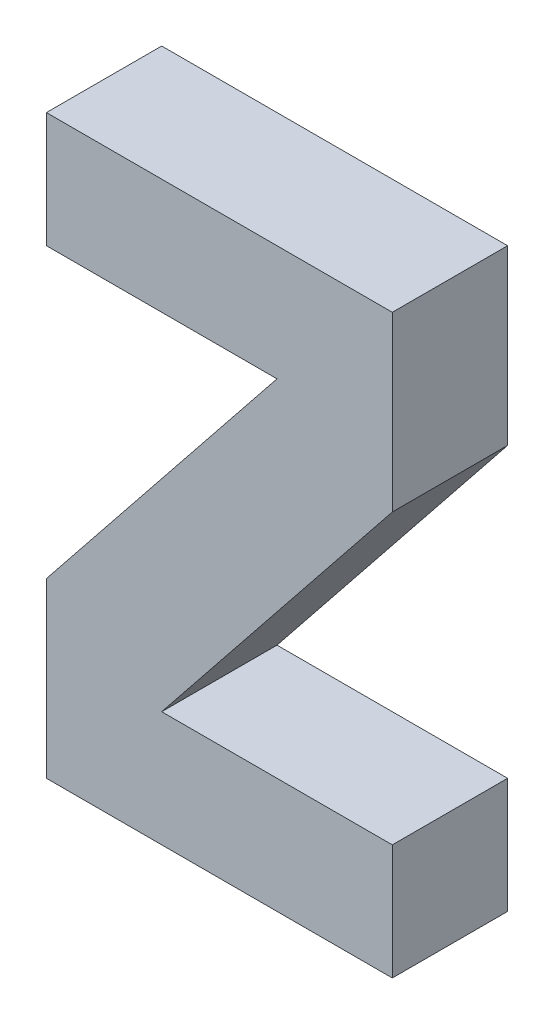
ISO-10303-21;
HEADER;
FILE_DESCRIPTION(('STEP AP214'),'2;1');
FILE_NAME('part.step','',(''),(''),'','','');
FILE_SCHEMA(('AUTOMOTIVE_DESIGN { 1 0 10303 214 1 1 1 1 }'));
ENDSEC;
DATA;
#1=APPLICATION_CONTEXT('core data for automotive mechanical design processes');
#2=APPLICATION_PROTOCOL_DEFINITION('international standard','automotive_design',2000,#1);
#3=PRODUCT_CONTEXT('',#1,'mechanical');
#4=PRODUCT('Part','Part','',(#3));
#5=PRODUCT_RELATED_PRODUCT_CATEGORY('part','',(#4));
#6=PRODUCT_DEFINITION_FORMATION('','',#4);
#7=PRODUCT_DEFINITION_CONTEXT('part definition',#1,'design');
#8=PRODUCT_DEFINITION('design','',#6,#7);
#9=PRODUCT_DEFINITION_SHAPE('','',#8);
#10=(LENGTH_UNIT() NAMED_UNIT(*) SI_UNIT(.MILLI.,.METRE.));
#11=(NAMED_UNIT(*) PLANE_ANGLE_UNIT() SI_UNIT($,.RADIAN.));
#12=(NAMED_UNIT(*) SI_UNIT($,.STERADIAN.) SOLID_ANGLE_UNIT());
#13=UNCERTAINTY_MEASURE_WITH_UNIT(LENGTH_MEASURE(1.E-05),#10,'distance_accuracy_value','');
#14=(GEOMETRIC_REPRESENTATION_CONTEXT(3) GLOBAL_UNCERTAINTY_ASSIGNED_CONTEXT((#13)) GLOBAL_UNIT_ASSIGNED_CONTEXT((#10,
#11,#12)) REPRESENTATION_CONTEXT('',''));
#15=CARTESIAN_POINT('',(0.,0.,0.));
#16=DIRECTION('',(0.,0.,1.));
#17=DIRECTION('',(1.,0.,0.));
#18=AXIS2_PLACEMENT_3D('',#15,#16,#17);
#19=CARTESIAN_POINT('',(0.,0.,10.));
#20=DIRECTION('',(1.,0.,0.));
#21=DIRECTION('',(0.,0.,-1.));
#22=AXIS2_PLACEMENT_3D('',#19,#20,#21);
#23=PLANE('',#22);
#24=DIRECTION('',(0.,-1.,0.));
#25=VECTOR('',#24,1.);
#26=CARTESIAN_POINT('',(0.,0.,0.));
#27=LINE('',#26,#25);
#28=CARTESIAN_POINT('',(0.,15.,0.));
#29=VERTEX_POINT('',#28);
#30=CARTESIAN_POINT('',(0.,0.,0.));
#31=VERTEX_POINT('',#30);
#32=EDGE_CURVE('E141',#29,#31,#27,.T.);
#33=ORIENTED_EDGE('',*,*,#32,.T.);
#34=DIRECTION('',(0.,0.,-1.));
#35=VECTOR('',#34,1.);
#36=CARTESIAN_POINT('',(0.,0.,10.));
#37=LINE('',#36,#35);
#38=CARTESIAN_POINT('',(0.,0.,10.));
#39=VERTEX_POINT('',#38);
#40=EDGE_CURVE('E11',#39,#31,#37,.T.);
#41=ORIENTED_EDGE('',*,*,#40,.F.);
#42=DIRECTION('',(0.,-1.,0.));
#43=VECTOR('',#42,1.);
#44=CARTESIAN_POINT('',(0.,0.,10.));
#45=LINE('',#44,#43);
#46=CARTESIAN_POINT('',(0.,15.,10.));
#47=VERTEX_POINT('',#46);
#48=EDGE_CURVE('E159',#47,#39,#45,.T.);
#49=ORIENTED_EDGE('',*,*,#48,.F.);
#50=DIRECTION('',(0.,0.,-1.));
#51=VECTOR('',#50,1.);
#52=CARTESIAN_POINT('',(0.,15.,10.));
#53=LINE('',#52,#51);
#54=EDGE_CURVE('E137',#47,#29,#53,.T.);
#55=ORIENTED_EDGE('',*,*,#54,.T.);
#56=EDGE_LOOP('',(#33,#41,#49,#55));
#57=FACE_BOUND('',#56,.T.);
#58=ADVANCED_FACE('F33',(#57),#23,.F.);
#59=CARTESIAN_POINT('',(0.,0.,10.));
#60=DIRECTION('',(0.,1.,0.));
#61=DIRECTION('',(0.,0.,1.));
#62=AXIS2_PLACEMENT_3D('',#59,#60,#61);
#63=PLANE('',#62);
#64=DIRECTION('',(1.,0.,0.));
#65=VECTOR('',#64,1.);
#66=CARTESIAN_POINT('',(0.,0.,0.));
#67=LINE('',#66,#65);
#68=CARTESIAN_POINT('',(30.,0.,0.));
#69=VERTEX_POINT('',#68);
#70=EDGE_CURVE('E144',#31,#69,#67,.T.);
#71=ORIENTED_EDGE('',*,*,#70,.T.);
#72=DIRECTION('',(0.,0.,-1.));
#73=VECTOR('',#72,1.);
#74=CARTESIAN_POINT('',(30.,0.,10.));
#75=LINE('',#74,#73);
#76=CARTESIAN_POINT('',(30.,0.,10.));
#77=VERTEX_POINT('',#76);
#78=EDGE_CURVE('E41',#77,#69,#75,.T.);
#79=ORIENTED_EDGE('',*,*,#78,.F.);
#80=DIRECTION('',(1.,0.,0.));
#81=VECTOR('',#80,1.);
#82=CARTESIAN_POINT('',(0.,0.,10.));
#83=LINE('',#82,#81);
#84=EDGE_CURVE('E98',#39,#77,#83,.T.);
#85=ORIENTED_EDGE('',*,*,#84,.F.);
#86=ORIENTED_EDGE('',*,*,#40,.T.);
#87=EDGE_LOOP('',(#71,#79,#85,#86));
#88=FACE_BOUND('',#87,.T.);
#89=ADVANCED_FACE('F208',(#88),#63,.F.);
#90=CARTESIAN_POINT('',(30.,0.,10.));
#91=DIRECTION('',(-1.,0.,0.));
#92=DIRECTION('',(0.,0.,1.));
#93=AXIS2_PLACEMENT_3D('',#90,#91,#92);
#94=PLANE('',#93);
#95=DIRECTION('',(0.,1.,0.));
#96=VECTOR('',#95,1.);
#97=CARTESIAN_POINT('',(30.,0.,0.));
#98=LINE('',#97,#96);
#99=CARTESIAN_POINT('',(30.,10.,0.));
#100=VERTEX_POINT('',#99);
#101=EDGE_CURVE('E146',#69,#100,#98,.T.);
#102=ORIENTED_EDGE('',*,*,#101,.T.);
#103=DIRECTION('',(0.,0.,-1.));
#104=VECTOR('',#103,1.);
#105=CARTESIAN_POINT('',(30.,10.,10.));
#106=LINE('',#105,#104);
#107=CARTESIAN_POINT('',(30.,10.,10.));
#108=VERTEX_POINT('',#107);
#109=EDGE_CURVE('E172',#108,#100,#106,.T.);
#110=ORIENTED_EDGE('',*,*,#109,.F.);
#111=DIRECTION('',(0.,1.,0.));
#112=VECTOR('',#111,1.);
#113=CARTESIAN_POINT('',(30.,0.,10.));
#114=LINE('',#113,#112);
#115=EDGE_CURVE('E180',#77,#108,#114,.T.);
#116=ORIENTED_EDGE('',*,*,#115,.F.);
#117=ORIENTED_EDGE('',*,*,#78,.T.);
#118=EDGE_LOOP('',(#102,#110,#116,#117));
#119=FACE_BOUND('',#118,.T.);
#120=ADVANCED_FACE('F178',(#119),#94,.F.);
#121=CARTESIAN_POINT('',(30.,10.,10.));
#122=DIRECTION('',(0.,-1.,0.));
#123=DIRECTION('',(1.,0.,0.));
#124=AXIS2_PLACEMENT_3D('',#121,#122,#123);
#125=PLANE('',#124);
#126=DIRECTION('',(-1.,0.,0.));
#127=VECTOR('',#126,1.);
#128=CARTESIAN_POINT('',(30.,10.,0.));
#129=LINE('',#128,#127);
#130=CARTESIAN_POINT('',(10.,10.,0.));
#131=VERTEX_POINT('',#130);
#132=EDGE_CURVE('E148',#100,#131,#129,.T.);
#133=ORIENTED_EDGE('',*,*,#132,.T.);
#134=DIRECTION('',(0.,0.,-1.));
#135=VECTOR('',#134,1.);
#136=CARTESIAN_POINT('',(10.,10.,10.));
#137=LINE('',#136,#135);
#138=CARTESIAN_POINT('',(10.,10.,10.));
#139=VERTEX_POINT('',#138);
#140=EDGE_CURVE('E169',#139,#131,#137,.T.);
#141=ORIENTED_EDGE('',*,*,#140,.F.);
#142=DIRECTION('',(-1.,0.,0.));
#143=VECTOR('',#142,1.);
#144=CARTESIAN_POINT('',(30.,10.,10.));
#145=LINE('',#144,#143);
#146=EDGE_CURVE('E198',#108,#139,#145,.T.);
#147=ORIENTED_EDGE('',*,*,#146,.F.);
#148=ORIENTED_EDGE('',*,*,#109,.T.);
#149=EDGE_LOOP('',(#133,#141,#147,#148));
#150=FACE_BOUND('',#149,.T.);
#151=ADVANCED_FACE('F189',(#150),#125,.F.);
#152=CARTESIAN_POINT('',(10.,10.,10.));
#153=DIRECTION('',(-0.78086880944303,0.624695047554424,0.));
#154=DIRECTION('',(-0.624695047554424,-0.78086880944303,0.));
#155=AXIS2_PLACEMENT_3D('',#152,#153,#154);
#156=PLANE('',#155);
#157=DIRECTION('',(0.624695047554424,0.78086880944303,0.));
#158=VECTOR('',#157,1.);
#159=CARTESIAN_POINT('',(10.,10.,0.));
#160=LINE('',#159,#158);
#161=CARTESIAN_POINT('',(30.,35.,0.));
#162=VERTEX_POINT('',#161);
#163=EDGE_CURVE('E150',#131,#162,#160,.T.);
#164=ORIENTED_EDGE('',*,*,#163,.T.);
#165=DIRECTION('',(0.,0.,-1.));
#166=VECTOR('',#165,1.);
#167=CARTESIAN_POINT('',(30.,35.,10.));
#168=LINE('',#167,#166);
#169=CARTESIAN_POINT('',(30.,35.,10.));
#170=VERTEX_POINT('',#169);
#171=EDGE_CURVE('E166',#170,#162,#168,.T.);
#172=ORIENTED_EDGE('',*,*,#171,.F.);
#173=DIRECTION('',(0.624695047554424,0.78086880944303,0.));
#174=VECTOR('',#173,1.);
#175=CARTESIAN_POINT('',(10.,10.,10.));
#176=LINE('',#175,#174);
#177=EDGE_CURVE('E195',#139,#170,#176,.T.);
#178=ORIENTED_EDGE('',*,*,#177,.F.);
#179=ORIENTED_EDGE('',*,*,#140,.T.);
#180=EDGE_LOOP('',(#164,#172,#178,#179));
#181=FACE_BOUND('',#180,.T.);
#182=ADVANCED_FACE('F193',(#181),#156,.F.);
#183=CARTESIAN_POINT('',(30.,35.,10.));
#184=DIRECTION('',(-1.,0.,0.));
#185=DIRECTION('',(0.,0.,1.));
#186=AXIS2_PLACEMENT_3D('',#183,#184,#185);
#187=PLANE('',#186);
#188=DIRECTION('',(0.,1.,0.));
#189=VECTOR('',#188,1.);
#190=CARTESIAN_POINT('',(30.,35.,0.));
#191=LINE('',#190,#189);
#192=CARTESIAN_POINT('',(30.,50.,0.));
#193=VERTEX_POINT('',#192);
#194=EDGE_CURVE('E152',#162,#193,#191,.T.);
#195=ORIENTED_EDGE('',*,*,#194,.T.);
#196=DIRECTION('',(0.,0.,-1.));
#197=VECTOR('',#196,1.);
#198=CARTESIAN_POINT('',(30.,50.,10.));
#199=LINE('',#198,#197);
#200=CARTESIAN_POINT('',(30.,50.,10.));
#201=VERTEX_POINT('',#200);
#202=EDGE_CURVE('E163',#201,#193,#199,.T.);
#203=ORIENTED_EDGE('',*,*,#202,.F.);
#204=DIRECTION('',(0.,1.,0.));
#205=VECTOR('',#204,1.);
#206=CARTESIAN_POINT('',(30.,35.,10.));
#207=LINE('',#206,#205);
#208=EDGE_CURVE('E197',#170,#201,#207,.T.);
#209=ORIENTED_EDGE('',*,*,#208,.F.);
#210=ORIENTED_EDGE('',*,*,#171,.T.);
#211=EDGE_LOOP('',(#195,#203,#209,#210));
#212=FACE_BOUND('',#211,.T.);
#213=ADVANCED_FACE('F220',(#212),#187,.F.);
#214=CARTESIAN_POINT('',(0.,50.,10.));
#215=DIRECTION('',(0.,-1.,0.));
#216=DIRECTION('',(0.,0.,-1.));
#217=AXIS2_PLACEMENT_3D('',#214,#215,#216);
#218=PLANE('',#217);
#219=DIRECTION('',(-1.,0.,0.));
#220=VECTOR('',#219,1.);
#221=CARTESIAN_POINT('',(0.,50.,0.));
#222=LINE('',#221,#220);
#223=CARTESIAN_POINT('',(0.,50.,0.));
#224=VERTEX_POINT('',#223);
#225=EDGE_CURVE('E154',#193,#224,#222,.T.);
#226=ORIENTED_EDGE('',*,*,#225,.T.);
#227=DIRECTION('',(0.,0.,-1.));
#228=VECTOR('',#227,1.);
#229=CARTESIAN_POINT('',(0.,50.,10.));
#230=LINE('',#229,#228);
#231=CARTESIAN_POINT('',(0.,50.,10.));
#232=VERTEX_POINT('',#231);
#233=EDGE_CURVE('E132',#232,#224,#230,.T.);
#234=ORIENTED_EDGE('',*,*,#233,.F.);
#235=DIRECTION('',(-1.,0.,0.));
#236=VECTOR('',#235,1.);
#237=CARTESIAN_POINT('',(0.,50.,10.));
#238=LINE('',#237,#236);
#239=EDGE_CURVE('E123',#201,#232,#238,.T.);
#240=ORIENTED_EDGE('',*,*,#239,.F.);
#241=ORIENTED_EDGE('',*,*,#202,.T.);
#242=EDGE_LOOP('',(#226,#234,#240,#241));
#243=FACE_BOUND('',#242,.T.);
#244=ADVANCED_FACE('F223',(#243),#218,.F.);
#245=CARTESIAN_POINT('',(0.,40.,10.));
#246=DIRECTION('',(1.,0.,0.));
#247=DIRECTION('',(0.,0.,-1.));
#248=AXIS2_PLACEMENT_3D('',#245,#246,#247);
#249=PLANE('',#248);
#250=DIRECTION('',(0.,-1.,0.));
#251=VECTOR('',#250,1.);
#252=CARTESIAN_POINT('',(0.,40.,0.));
#253=LINE('',#252,#251);
#254=CARTESIAN_POINT('',(0.,40.,0.));
#255=VERTEX_POINT('',#254);
#256=EDGE_CURVE('E131',#224,#255,#253,.T.);
#257=ORIENTED_EDGE('',*,*,#256,.T.);
#258=DIRECTION('',(0.,0.,-1.));
#259=VECTOR('',#258,1.);
#260=CARTESIAN_POINT('',(0.,40.,10.));
#261=LINE('',#260,#259);
#262=CARTESIAN_POINT('',(0.,40.,10.));
#263=VERTEX_POINT('',#262);
#264=EDGE_CURVE('E128',#263,#255,#261,.T.);
#265=ORIENTED_EDGE('',*,*,#264,.F.);
#266=DIRECTION('',(0.,-1.,0.));
#267=VECTOR('',#266,1.);
#268=CARTESIAN_POINT('',(0.,40.,10.));
#269=LINE('',#268,#267);
#270=EDGE_CURVE('E117',#232,#263,#269,.T.);
#271=ORIENTED_EDGE('',*,*,#270,.F.);
#272=ORIENTED_EDGE('',*,*,#233,.T.);
#273=EDGE_LOOP('',(#257,#265,#271,#272));
#274=FACE_BOUND('',#273,.T.);
#275=ADVANCED_FACE('F129',(#274),#249,.F.);
#276=CARTESIAN_POINT('',(0.,40.,10.));
#277=DIRECTION('',(0.,1.,0.));
#278=DIRECTION('',(0.,0.,1.));
#279=AXIS2_PLACEMENT_3D('',#276,#277,#278);
#280=PLANE('',#279);
#281=DIRECTION('',(1.,0.,0.));
#282=VECTOR('',#281,1.);
#283=CARTESIAN_POINT('',(0.,40.,0.));
#284=LINE('',#283,#282);
#285=CARTESIAN_POINT('',(20.,40.,0.));
#286=VERTEX_POINT('',#285);
#287=EDGE_CURVE('E84',#255,#286,#284,.T.);
#288=ORIENTED_EDGE('',*,*,#287,.T.);
#289=DIRECTION('',(0.,0.,-1.));
#290=VECTOR('',#289,1.);
#291=CARTESIAN_POINT('',(20.,40.,10.));
#292=LINE('',#291,#290);
#293=CARTESIAN_POINT('',(20.,40.,10.));
#294=VERTEX_POINT('',#293);
#295=EDGE_CURVE('E133',#294,#286,#292,.T.);
#296=ORIENTED_EDGE('',*,*,#295,.F.);
#297=DIRECTION('',(1.,0.,0.));
#298=VECTOR('',#297,1.);
#299=CARTESIAN_POINT('',(0.,40.,10.));
#300=LINE('',#299,#298);
#301=EDGE_CURVE('E121',#263,#294,#300,.T.);
#302=ORIENTED_EDGE('',*,*,#301,.F.);
#303=ORIENTED_EDGE('',*,*,#264,.T.);
#304=EDGE_LOOP('',(#288,#296,#302,#303));
#305=FACE_BOUND('',#304,.T.);
#306=ADVANCED_FACE('F135',(#305),#280,.F.);
#307=CARTESIAN_POINT('',(20.,40.,10.));
#308=DIRECTION('',(0.78086880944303,-0.624695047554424,0.));
#309=DIRECTION('',(0.624695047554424,0.78086880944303,0.));
#310=AXIS2_PLACEMENT_3D('',#307,#308,#309);
#311=PLANE('',#310);
#312=DIRECTION('',(-0.624695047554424,-0.78086880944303,0.));
#313=VECTOR('',#312,1.);
#314=CARTESIAN_POINT('',(20.,40.,0.));
#315=LINE('',#314,#313);
#316=EDGE_CURVE('E90',#286,#29,#315,.T.);
#317=ORIENTED_EDGE('',*,*,#316,.T.);
#318=ORIENTED_EDGE('',*,*,#54,.F.);
#319=DIRECTION('',(-0.624695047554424,-0.78086880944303,0.));
#320=VECTOR('',#319,1.);
#321=CARTESIAN_POINT('',(20.,40.,10.));
#322=LINE('',#321,#320);
#323=EDGE_CURVE('E49',#294,#47,#322,.T.);
#324=ORIENTED_EDGE('',*,*,#323,.F.);
#325=ORIENTED_EDGE('',*,*,#295,.T.);
#326=EDGE_LOOP('',(#317,#318,#324,#325));
#327=FACE_BOUND('',#326,.T.);
#328=ADVANCED_FACE('F232',(#327),#311,.F.);
#329=CARTESIAN_POINT('',(0.,0.,10.));
#330=DIRECTION('',(0.,0.,-1.));
#331=DIRECTION('',(-1.,0.,0.));
#332=AXIS2_PLACEMENT_3D('',#329,#330,#331);
#333=PLANE('',#332);
#334=ORIENTED_EDGE('',*,*,#48,.T.);
#335=ORIENTED_EDGE('',*,*,#84,.T.);
#336=ORIENTED_EDGE('',*,*,#115,.T.);
#337=ORIENTED_EDGE('',*,*,#146,.T.);
#338=ORIENTED_EDGE('',*,*,#177,.T.);
#339=ORIENTED_EDGE('',*,*,#208,.T.);
#340=ORIENTED_EDGE('',*,*,#239,.T.);
#341=ORIENTED_EDGE('',*,*,#270,.T.);
#342=ORIENTED_EDGE('',*,*,#301,.T.);
#343=ORIENTED_EDGE('',*,*,#323,.T.);
#344=EDGE_LOOP('',(#334,#335,#336,#337,#338,#339,#340,#341,#342,#343));
#345=FACE_BOUND('',#344,.T.);
#346=ADVANCED_FACE('F119',(#345),#333,.F.);
#347=CARTESIAN_POINT('',(0.,0.,0.));
#348=DIRECTION('',(0.,0.,-1.));
#349=DIRECTION('',(-1.,0.,0.));
#350=AXIS2_PLACEMENT_3D('',#347,#348,#349);
#351=PLANE('',#350);
#352=ORIENTED_EDGE('',*,*,#32,.F.);
#353=ORIENTED_EDGE('',*,*,#316,.F.);
#354=ORIENTED_EDGE('',*,*,#287,.F.);
#355=ORIENTED_EDGE('',*,*,#256,.F.);
#356=ORIENTED_EDGE('',*,*,#225,.F.);
#357=ORIENTED_EDGE('',*,*,#194,.F.);
#358=ORIENTED_EDGE('',*,*,#163,.F.);
#359=ORIENTED_EDGE('',*,*,#132,.F.);
#360=ORIENTED_EDGE('',*,*,#101,.F.);
#361=ORIENTED_EDGE('',*,*,#70,.F.);
#362=EDGE_LOOP('',(#352,#353,#354,#355,#356,#357,#358,#359,#360,#361));
#363=FACE_BOUND('',#362,.T.);
#364=ADVANCED_FACE('F184',(#363),#351,.T.);
#365=CLOSED_SHELL('',(#58,#89,#120,#151,#182,#213,#244,#275,#306,#328,#346,#364));
#366=MANIFOLD_SOLID_BREP('B2',#365);
#367=ADVANCED_BREP_SHAPE_REPRESENTATION('',(#18,#366),#14);
#368=SHAPE_DEFINITION_REPRESENTATION(#9,#367);
ENDSEC;
END-ISO-10303-21;
